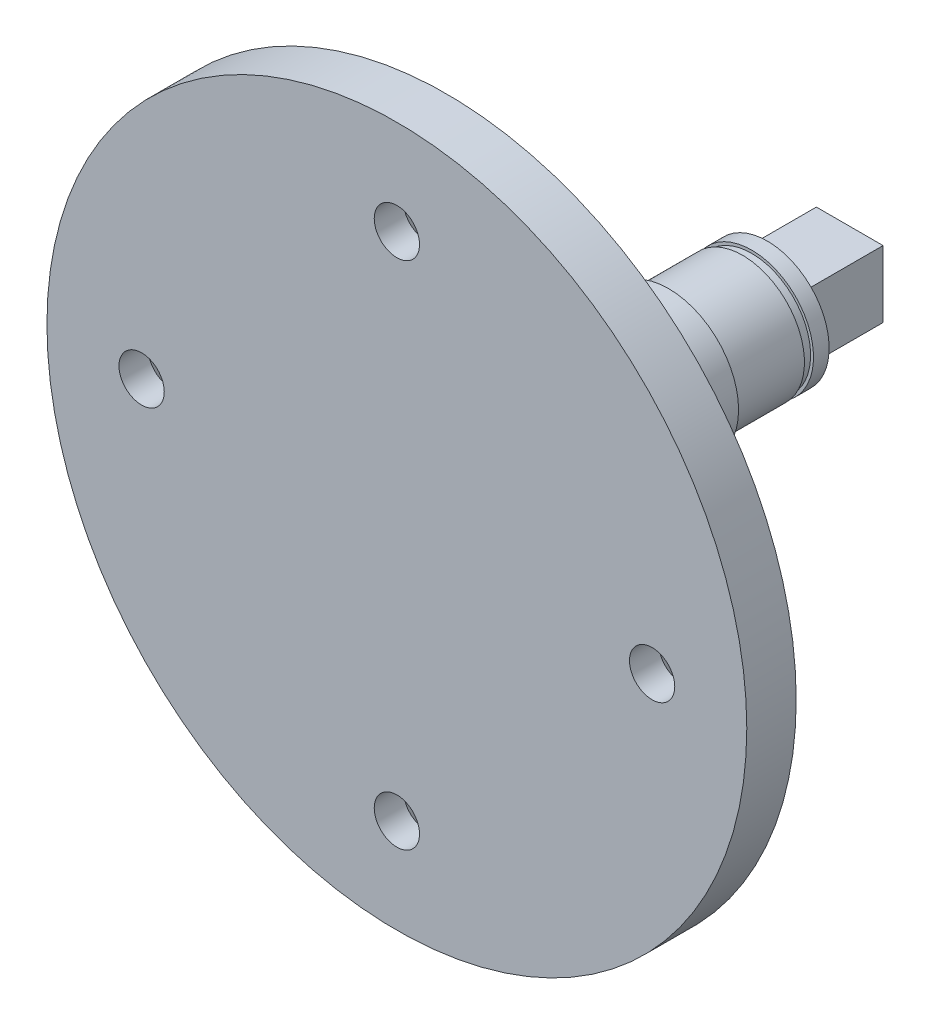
from build123d import *

# Parameters (mm, degrees)
SZKIC1_R                                             = 42.5
DODANIE_WYCI_GNI_CIE1_DEPTH                          = 6
SZKIC2_R                                             = 7.5
DODANIE_WYCI_GNI_CIE2_DEPTH                          = 39
SZKIC3_R                                             = 8.5
DODANIE_WYCI_GNI_CIE3_DEPTH                          = 27
SZKIC4_W                                             = 8.1
SZKIC4_H                                             = 8.1
DODANIE_WYCI_GNI_CIE4_DEPTH                          = 10
POG_BIENIE_STO_KOWE_POD_M5_WKR_T_DO_CZ_C_D           = 5.5
POG_BIENIE_STO_KOWE_POD_M5_WKR_T_DO_CZ_C_CSINK_D     = 10.4
POG_BIENIE_STO_KOWE_POD_M5_WKR_T_DO_CZ_C_CSINK_ANGLE = 90
SZKIC7_R                                             = 7.5
SZKIC7_R_2                                           = 7.15
WYTNIJ_WYCI_GNI_CIE1_DEPTH                           = 1.1


with BuildPart() as part:
    # Szkic1 → Dodanie-wyci_gni_cie1 (new body)
    with BuildSketch(Plane.XY):
        Circle(SZKIC1_R)
    extrude(amount=DODANIE_WYCI_GNI_CIE1_DEPTH)

    # Szkic2 → Dodanie-wyci_gni_cie2 (add)
    with BuildSketch(Plane(origin=(0, 0, 0), x_dir=(-1, 0, 0), z_dir=(0, 0, -1))):
        with Locations(Location((0, 0, 0), (0, 0, 180))):
            Circle(SZKIC2_R)
    extrude(amount=DODANIE_WYCI_GNI_CIE2_DEPTH)

    # Szkic3 → Dodanie-wyci_gni_cie3 (add)
    with BuildSketch(Plane(origin=(0, 0, 0), x_dir=(-1, 0, 0), z_dir=(0, 0, -1))):
        with Locations(Location((0, 0, 0), (0, 0, 180))):
            Circle(SZKIC3_R)
    extrude(amount=DODANIE_WYCI_GNI_CIE3_DEPTH)

    # Szkic4 → Dodanie-wyci_gni_cie4 (add)
    with BuildSketch(Plane(origin=(0, 0, -39), x_dir=(-1, 0, 0), z_dir=(0, 0, -1))):
        Rectangle(SZKIC4_W, SZKIC4_H)
    extrude(amount=DODANIE_WYCI_GNI_CIE4_DEPTH)

    # Pog_bienie sto_kowe pod M5 wkr_t do cz_c (through all)
    with Locations(Plane(origin=(0, 0, 0), x_dir=(-1, 0, 0), z_dir=(0, 0, -1))):
        with Locations((0, 31), (31, 0), (0, -31), (-31, 0)):
            CounterSinkHole(POG_BIENIE_STO_KOWE_POD_M5_WKR_T_DO_CZ_C_D / 2, POG_BIENIE_STO_KOWE_POD_M5_WKR_T_DO_CZ_C_CSINK_D / 2, counter_sink_angle=POG_BIENIE_STO_KOWE_POD_M5_WKR_T_DO_CZ_C_CSINK_ANGLE)

    # Szkic7 → Wytnij-wyci_gni_cie1 (cut)
    with BuildSketch(Plane(origin=(0, 0, -36), x_dir=(-1, 0, 0), z_dir=(0, 0, -1))):
        Circle(SZKIC7_R)
        Circle(SZKIC7_R_2, mode=Mode.SUBTRACT)
    extrude(amount=WYTNIJ_WYCI_GNI_CIE1_DEPTH, mode=Mode.SUBTRACT)


solid = part.part
